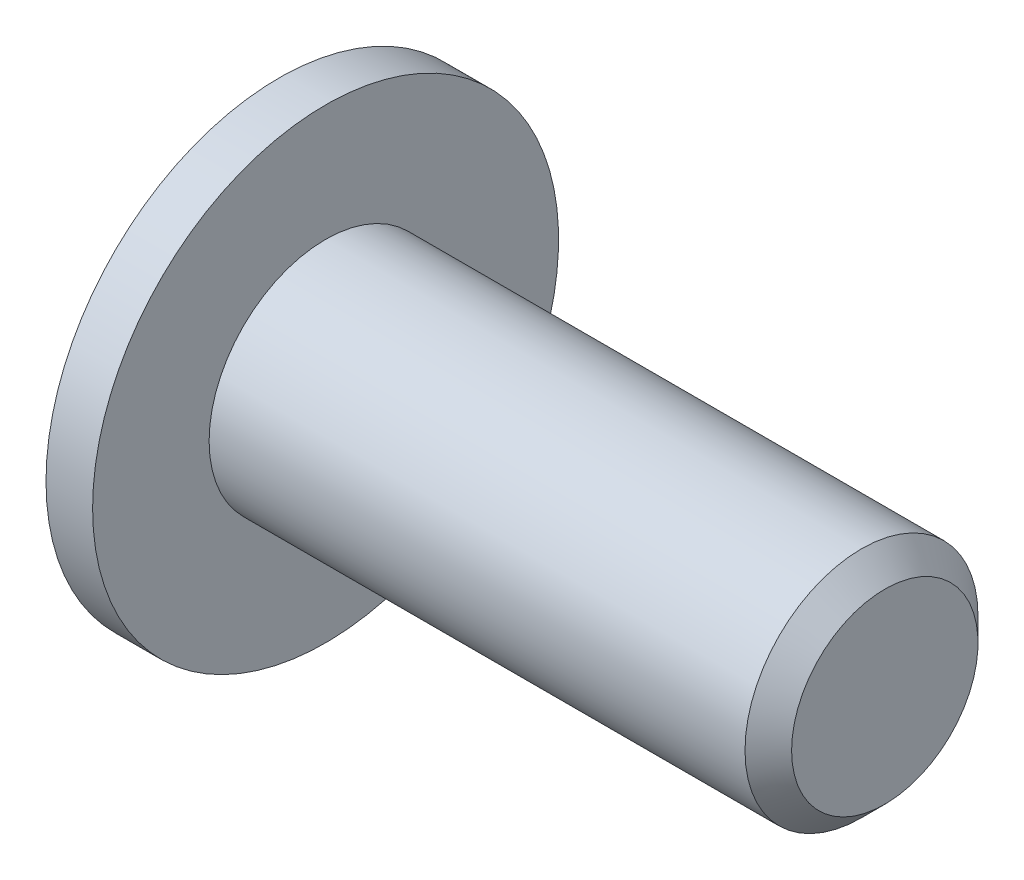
ISO-10303-21;
HEADER;
FILE_DESCRIPTION(('STEP AP214'),'2;1');
FILE_NAME('part.step','',(''),(''),'','','');
FILE_SCHEMA(('AUTOMOTIVE_DESIGN { 1 0 10303 214 1 1 1 1 }'));
ENDSEC;
DATA;
#1=APPLICATION_CONTEXT('core data for automotive mechanical design processes');
#2=APPLICATION_PROTOCOL_DEFINITION('international standard','automotive_design',2000,#1);
#3=PRODUCT_CONTEXT('',#1,'mechanical');
#4=PRODUCT('Part','Part','',(#3));
#5=PRODUCT_RELATED_PRODUCT_CATEGORY('part','',(#4));
#6=PRODUCT_DEFINITION_FORMATION('','',#4);
#7=PRODUCT_DEFINITION_CONTEXT('part definition',#1,'design');
#8=PRODUCT_DEFINITION('design','',#6,#7);
#9=PRODUCT_DEFINITION_SHAPE('','',#8);
#10=(LENGTH_UNIT() NAMED_UNIT(*) SI_UNIT(.MILLI.,.METRE.));
#11=(NAMED_UNIT(*) PLANE_ANGLE_UNIT() SI_UNIT($,.RADIAN.));
#12=(NAMED_UNIT(*) SI_UNIT($,.STERADIAN.) SOLID_ANGLE_UNIT());
#13=UNCERTAINTY_MEASURE_WITH_UNIT(LENGTH_MEASURE(1.E-05),#10,'distance_accuracy_value','');
#14=(GEOMETRIC_REPRESENTATION_CONTEXT(3) GLOBAL_UNCERTAINTY_ASSIGNED_CONTEXT((#13)) GLOBAL_UNIT_ASSIGNED_CONTEXT((#10,
#11,#12)) REPRESENTATION_CONTEXT('',''));
#15=CARTESIAN_POINT('',(0.,0.,0.));
#16=DIRECTION('',(0.,0.,1.));
#17=DIRECTION('',(1.,0.,0.));
#18=AXIS2_PLACEMENT_3D('',#15,#16,#17);
#19=CARTESIAN_POINT('',(12.,0.,0.));
#20=DIRECTION('',(-1.,0.,0.));
#21=DIRECTION('',(0.,0.,1.));
#22=AXIS2_PLACEMENT_3D('',#19,#20,#21);
#23=PLANE('',#22);
#24=CARTESIAN_POINT('',(12.,0.,0.));
#25=DIRECTION('',(-1.,0.,0.));
#26=DIRECTION('',(0.,0.,1.));
#27=AXIS2_PLACEMENT_3D('',#24,#25,#26);
#28=CIRCLE('',#27,2.);
#29=CARTESIAN_POINT('',(12.,0.,2.));
#30=VERTEX_POINT('',#29);
#31=EDGE_CURVE('E139',#30,#30,#28,.F.);
#32=ORIENTED_EDGE('',*,*,#31,.T.);
#33=EDGE_LOOP('',(#32));
#34=FACE_BOUND('',#33,.T.);
#35=ADVANCED_FACE('F35',(#34),#23,.F.);
#36=CARTESIAN_POINT('',(0.,0.,0.));
#37=DIRECTION('',(-1.,0.,0.));
#38=DIRECTION('',(0.,0.,1.));
#39=AXIS2_PLACEMENT_3D('',#36,#37,#38);
#40=CYLINDRICAL_SURFACE('',#39,2.5);
#41=CARTESIAN_POINT('',(11.5,0.,0.));
#42=DIRECTION('',(-1.,0.,0.));
#43=DIRECTION('',(0.,0.,1.));
#44=AXIS2_PLACEMENT_3D('',#41,#42,#43);
#45=CIRCLE('',#44,2.5);
#46=CARTESIAN_POINT('',(11.5,0.,2.5));
#47=VERTEX_POINT('',#46);
#48=EDGE_CURVE('E136',#47,#47,#45,.T.);
#49=ORIENTED_EDGE('',*,*,#48,.T.);
#50=EDGE_LOOP('',(#49));
#51=FACE_BOUND('',#50,.T.);
#52=CARTESIAN_POINT('',(0.,0.,0.));
#53=DIRECTION('',(-1.,0.,0.));
#54=DIRECTION('',(0.,0.,1.));
#55=AXIS2_PLACEMENT_3D('',#52,#53,#54);
#56=CIRCLE('',#55,2.5);
#57=CARTESIAN_POINT('',(0.,0.,2.5));
#58=VERTEX_POINT('',#57);
#59=EDGE_CURVE('E133',#58,#58,#56,.T.);
#60=ORIENTED_EDGE('',*,*,#59,.F.);
#61=EDGE_LOOP('',(#60));
#62=FACE_BOUND('',#61,.T.);
#63=ADVANCED_FACE('F176',(#51,#62),#40,.T.);
#64=CARTESIAN_POINT('',(0.,2.5,0.));
#65=DIRECTION('',(-1.,0.,0.));
#66=DIRECTION('',(0.,0.,1.));
#67=AXIS2_PLACEMENT_3D('',#64,#65,#66);
#68=PLANE('',#67);
#69=CARTESIAN_POINT('',(0.,0.,0.));
#70=DIRECTION('',(-1.,0.,0.));
#71=DIRECTION('',(0.,0.,1.));
#72=AXIS2_PLACEMENT_3D('',#69,#70,#71);
#73=CIRCLE('',#72,5.);
#74=CARTESIAN_POINT('',(0.,0.,5.));
#75=VERTEX_POINT('',#74);
#76=EDGE_CURVE('E130',#75,#75,#73,.T.);
#77=ORIENTED_EDGE('',*,*,#76,.F.);
#78=EDGE_LOOP('',(#77));
#79=FACE_BOUND('',#78,.T.);
#80=ORIENTED_EDGE('',*,*,#59,.T.);
#81=EDGE_LOOP('',(#80));
#82=FACE_BOUND('',#81,.T.);
#83=ADVANCED_FACE('F181',(#79,#82),#68,.F.);
#84=CARTESIAN_POINT('',(0.,0.,0.));
#85=DIRECTION('',(-1.,0.,0.));
#86=DIRECTION('',(0.,0.,1.));
#87=AXIS2_PLACEMENT_3D('',#84,#85,#86);
#88=CYLINDRICAL_SURFACE('',#87,5.);
#89=CARTESIAN_POINT('',(-1.,0.,0.));
#90=DIRECTION('',(-1.,0.,0.));
#91=DIRECTION('',(0.,0.,1.));
#92=AXIS2_PLACEMENT_3D('',#89,#90,#91);
#93=CIRCLE('',#92,5.);
#94=CARTESIAN_POINT('',(-1.,0.,5.));
#95=VERTEX_POINT('',#94);
#96=EDGE_CURVE('E127',#95,#95,#93,.T.);
#97=ORIENTED_EDGE('',*,*,#96,.F.);
#98=EDGE_LOOP('',(#97));
#99=FACE_BOUND('',#98,.T.);
#100=ORIENTED_EDGE('',*,*,#76,.T.);
#101=EDGE_LOOP('',(#100));
#102=FACE_BOUND('',#101,.T.);
#103=ADVANCED_FACE('F187',(#99,#102),#88,.T.);
#104=CARTESIAN_POINT('',(-1.,5.,0.));
#105=DIRECTION('',(1.,0.,0.));
#106=DIRECTION('',(0.,0.,-1.));
#107=AXIS2_PLACEMENT_3D('',#104,#105,#106);
#108=PLANE('',#107);
#109=CARTESIAN_POINT('',(-1.,0.,0.));
#110=DIRECTION('',(-1.,0.,0.));
#111=DIRECTION('',(0.,0.,1.));
#112=AXIS2_PLACEMENT_3D('',#109,#110,#111);
#113=CIRCLE('',#112,3.57071421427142);
#114=CARTESIAN_POINT('',(-1.,0.,3.57071421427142));
#115=VERTEX_POINT('',#114);
#116=EDGE_CURVE('E117',#115,#115,#113,.T.);
#117=ORIENTED_EDGE('',*,*,#116,.F.);
#118=EDGE_LOOP('',(#117));
#119=FACE_BOUND('',#118,.T.);
#120=ORIENTED_EDGE('',*,*,#96,.T.);
#121=EDGE_LOOP('',(#120));
#122=FACE_BOUND('',#121,.T.);
#123=ADVANCED_FACE('F191',(#119,#122),#108,.F.);
#124=CARTESIAN_POINT('',(2.5,0.,0.));
#125=DIRECTION('',(-1.,0.,0.));
#126=DIRECTION('',(0.,1.,0.));
#127=AXIS2_PLACEMENT_3D('',#124,#125,#126);
#128=SPHERICAL_SURFACE('',#127,5.);
#129=CARTESIAN_POINT('',(2.5,0.,-1.5));
#130=DIRECTION('',(0.,0.,-1.));
#131=DIRECTION('',(0.,1.,0.));
#132=AXIS2_PLACEMENT_3D('',#129,#130,#131);
#133=CIRCLE('',#132,4.76969600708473);
#134=CARTESIAN_POINT('',(-2.19041575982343,-0.866025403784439,-1.5));
#135=VERTEX_POINT('',#134);
#136=CARTESIAN_POINT('',(-2.19041575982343,0.866025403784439,-1.5));
#137=VERTEX_POINT('',#136);
#138=EDGE_CURVE('E43',#135,#137,#133,.T.);
#139=ORIENTED_EDGE('',*,*,#138,.T.);
#140=CARTESIAN_POINT('',(2.5,1.29903810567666,-0.75));
#141=DIRECTION('',(0.,0.866025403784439,-0.5));
#142=DIRECTION('',(0.,0.5,0.866025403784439));
#143=AXIS2_PLACEMENT_3D('',#140,#141,#142);
#144=CIRCLE('',#143,4.76969600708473);
#145=CARTESIAN_POINT('',(-2.19041575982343,1.73205080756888,0.));
#146=VERTEX_POINT('',#145);
#147=EDGE_CURVE('E11',#137,#146,#144,.T.);
#148=ORIENTED_EDGE('',*,*,#147,.T.);
#149=CARTESIAN_POINT('',(2.5,1.29903810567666,0.75));
#150=DIRECTION('',(0.,0.866025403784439,0.5));
#151=DIRECTION('',(0.,-0.5,0.866025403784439));
#152=AXIS2_PLACEMENT_3D('',#149,#150,#151);
#153=CIRCLE('',#152,4.76969600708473);
#154=CARTESIAN_POINT('',(-2.19041575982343,0.866025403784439,1.5));
#155=VERTEX_POINT('',#154);
#156=EDGE_CURVE('E89',#146,#155,#153,.T.);
#157=ORIENTED_EDGE('',*,*,#156,.T.);
#158=CARTESIAN_POINT('',(2.5,0.,1.5));
#159=DIRECTION('',(0.,0.,1.));
#160=DIRECTION('',(0.,-1.,0.));
#161=AXIS2_PLACEMENT_3D('',#158,#159,#160);
#162=CIRCLE('',#161,4.76969600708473);
#163=CARTESIAN_POINT('',(-2.19041575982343,-0.866025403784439,1.5));
#164=VERTEX_POINT('',#163);
#165=EDGE_CURVE('E143',#155,#164,#162,.T.);
#166=ORIENTED_EDGE('',*,*,#165,.T.);
#167=CARTESIAN_POINT('',(2.5,-1.29903810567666,0.749999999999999));
#168=DIRECTION('',(0.,-0.866025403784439,0.5));
#169=DIRECTION('',(0.,-0.5,-0.866025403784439));
#170=AXIS2_PLACEMENT_3D('',#167,#168,#169);
#171=CIRCLE('',#170,4.76969600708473);
#172=CARTESIAN_POINT('',(-2.19041575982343,-1.73205080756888,0.));
#173=VERTEX_POINT('',#172);
#174=EDGE_CURVE('E146',#164,#173,#171,.T.);
#175=ORIENTED_EDGE('',*,*,#174,.T.);
#176=CARTESIAN_POINT('',(2.5,-1.29903810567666,-0.75));
#177=DIRECTION('',(0.,-0.866025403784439,-0.5));
#178=DIRECTION('',(0.,0.5,-0.866025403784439));
#179=AXIS2_PLACEMENT_3D('',#176,#177,#178);
#180=CIRCLE('',#179,4.76969600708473);
#181=EDGE_CURVE('E149',#173,#135,#180,.T.);
#182=ORIENTED_EDGE('',*,*,#181,.T.);
#183=EDGE_LOOP('',(#139,#148,#157,#166,#175,#182));
#184=FACE_BOUND('',#183,.T.);
#185=ORIENTED_EDGE('',*,*,#116,.T.);
#186=EDGE_LOOP('',(#185));
#187=FACE_BOUND('',#186,.T.);
#188=ADVANCED_FACE('F153',(#184,#187),#128,.T.);
#189=CARTESIAN_POINT('',(11.5,0.,0.));
#190=DIRECTION('',(-1.,0.,0.));
#191=DIRECTION('',(0.,0.,1.));
#192=AXIS2_PLACEMENT_3D('',#189,#190,#191);
#193=CONICAL_SURFACE('',#192,2.5,0.785398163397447);
#194=ORIENTED_EDGE('',*,*,#31,.F.);
#195=EDGE_LOOP('',(#194));
#196=FACE_BOUND('',#195,.T.);
#197=ORIENTED_EDGE('',*,*,#48,.F.);
#198=EDGE_LOOP('',(#197));
#199=FACE_BOUND('',#198,.T.);
#200=ADVANCED_FACE('F37',(#196,#199),#193,.T.);
#201=CARTESIAN_POINT('',(-2.5,0.866025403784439,-1.5));
#202=DIRECTION('',(0.,0.866025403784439,-0.5));
#203=DIRECTION('',(0.,0.5,0.866025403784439));
#204=AXIS2_PLACEMENT_3D('',#201,#202,#203);
#205=PLANE('',#204);
#206=DIRECTION('',(1.,0.,0.));
#207=VECTOR('',#206,1.);
#208=CARTESIAN_POINT('',(-2.5,0.866025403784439,-1.5));
#209=LINE('',#208,#207);
#210=CARTESIAN_POINT('',(-1.,0.866025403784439,-1.5));
#211=VERTEX_POINT('',#210);
#212=EDGE_CURVE('E105',#137,#211,#209,.T.);
#213=ORIENTED_EDGE('',*,*,#212,.T.);
#214=DIRECTION('',(0.,0.5,0.866025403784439));
#215=VECTOR('',#214,1.);
#216=CARTESIAN_POINT('',(-1.,0.866025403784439,-1.5));
#217=LINE('',#216,#215);
#218=CARTESIAN_POINT('',(-1.,1.73205080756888,0.));
#219=VERTEX_POINT('',#218);
#220=EDGE_CURVE('E98',#211,#219,#217,.T.);
#221=ORIENTED_EDGE('',*,*,#220,.T.);
#222=DIRECTION('',(1.,0.,0.));
#223=VECTOR('',#222,1.);
#224=CARTESIAN_POINT('',(-2.5,1.73205080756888,0.));
#225=LINE('',#224,#223);
#226=EDGE_CURVE('E84',#146,#219,#225,.T.);
#227=ORIENTED_EDGE('',*,*,#226,.F.);
#228=ORIENTED_EDGE('',*,*,#147,.F.);
#229=EDGE_LOOP('',(#213,#221,#227,#228));
#230=FACE_BOUND('',#229,.T.);
#231=ADVANCED_FACE('F104',(#230),#205,.F.);
#232=CARTESIAN_POINT('',(-2.5,-0.866025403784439,-1.5));
#233=DIRECTION('',(0.,0.,-1.));
#234=DIRECTION('',(0.,1.,0.));
#235=AXIS2_PLACEMENT_3D('',#232,#233,#234);
#236=PLANE('',#235);
#237=DIRECTION('',(1.,0.,0.));
#238=VECTOR('',#237,1.);
#239=CARTESIAN_POINT('',(-2.5,-0.866025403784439,-1.5));
#240=LINE('',#239,#238);
#241=CARTESIAN_POINT('',(-1.,-0.866025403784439,-1.5));
#242=VERTEX_POINT('',#241);
#243=EDGE_CURVE('E118',#135,#242,#240,.T.);
#244=ORIENTED_EDGE('',*,*,#243,.T.);
#245=DIRECTION('',(0.,1.,0.));
#246=VECTOR('',#245,1.);
#247=CARTESIAN_POINT('',(-1.,-0.866025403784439,-1.5));
#248=LINE('',#247,#246);
#249=EDGE_CURVE('E91',#242,#211,#248,.T.);
#250=ORIENTED_EDGE('',*,*,#249,.T.);
#251=ORIENTED_EDGE('',*,*,#212,.F.);
#252=ORIENTED_EDGE('',*,*,#138,.F.);
#253=EDGE_LOOP('',(#244,#250,#251,#252));
#254=FACE_BOUND('',#253,.T.);
#255=ADVANCED_FACE('F157',(#254),#236,.F.);
#256=CARTESIAN_POINT('',(-2.5,-1.73205080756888,0.));
#257=DIRECTION('',(0.,-0.866025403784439,-0.5));
#258=DIRECTION('',(0.,0.5,-0.866025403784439));
#259=AXIS2_PLACEMENT_3D('',#256,#257,#258);
#260=PLANE('',#259);
#261=DIRECTION('',(1.,0.,0.));
#262=VECTOR('',#261,1.);
#263=CARTESIAN_POINT('',(-2.5,-1.73205080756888,0.));
#264=LINE('',#263,#262);
#265=CARTESIAN_POINT('',(-1.,-1.73205080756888,0.));
#266=VERTEX_POINT('',#265);
#267=EDGE_CURVE('E120',#173,#266,#264,.T.);
#268=ORIENTED_EDGE('',*,*,#267,.T.);
#269=DIRECTION('',(0.,0.5,-0.866025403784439));
#270=VECTOR('',#269,1.);
#271=CARTESIAN_POINT('',(-1.,-1.73205080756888,0.));
#272=LINE('',#271,#270);
#273=EDGE_CURVE('E112',#266,#242,#272,.T.);
#274=ORIENTED_EDGE('',*,*,#273,.T.);
#275=ORIENTED_EDGE('',*,*,#243,.F.);
#276=ORIENTED_EDGE('',*,*,#181,.F.);
#277=EDGE_LOOP('',(#268,#274,#275,#276));
#278=FACE_BOUND('',#277,.T.);
#279=ADVANCED_FACE('F159',(#278),#260,.F.);
#280=CARTESIAN_POINT('',(-2.5,-0.866025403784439,1.5));
#281=DIRECTION('',(0.,-0.866025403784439,0.5));
#282=DIRECTION('',(0.,-0.5,-0.866025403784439));
#283=AXIS2_PLACEMENT_3D('',#280,#281,#282);
#284=PLANE('',#283);
#285=DIRECTION('',(1.,0.,0.));
#286=VECTOR('',#285,1.);
#287=CARTESIAN_POINT('',(-2.5,-0.866025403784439,1.5));
#288=LINE('',#287,#286);
#289=CARTESIAN_POINT('',(-1.,-0.866025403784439,1.5));
#290=VERTEX_POINT('',#289);
#291=EDGE_CURVE('E122',#164,#290,#288,.T.);
#292=ORIENTED_EDGE('',*,*,#291,.T.);
#293=DIRECTION('',(0.,-0.5,-0.866025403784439));
#294=VECTOR('',#293,1.);
#295=CARTESIAN_POINT('',(-1.,-0.866025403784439,1.5));
#296=LINE('',#295,#294);
#297=EDGE_CURVE('E109',#290,#266,#296,.T.);
#298=ORIENTED_EDGE('',*,*,#297,.T.);
#299=ORIENTED_EDGE('',*,*,#267,.F.);
#300=ORIENTED_EDGE('',*,*,#174,.F.);
#301=EDGE_LOOP('',(#292,#298,#299,#300));
#302=FACE_BOUND('',#301,.T.);
#303=ADVANCED_FACE('F163',(#302),#284,.F.);
#304=CARTESIAN_POINT('',(-2.5,0.866025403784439,1.5));
#305=DIRECTION('',(0.,0.,1.));
#306=DIRECTION('',(0.,-1.,0.));
#307=AXIS2_PLACEMENT_3D('',#304,#305,#306);
#308=PLANE('',#307);
#309=DIRECTION('',(1.,0.,0.));
#310=VECTOR('',#309,1.);
#311=CARTESIAN_POINT('',(-2.5,0.866025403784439,1.5));
#312=LINE('',#311,#310);
#313=CARTESIAN_POINT('',(-1.,0.866025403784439,1.5));
#314=VERTEX_POINT('',#313);
#315=EDGE_CURVE('E50',#155,#314,#312,.T.);
#316=ORIENTED_EDGE('',*,*,#315,.T.);
#317=DIRECTION('',(0.,-1.,0.));
#318=VECTOR('',#317,1.);
#319=CARTESIAN_POINT('',(-1.,0.866025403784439,1.5));
#320=LINE('',#319,#318);
#321=EDGE_CURVE('E102',#314,#290,#320,.T.);
#322=ORIENTED_EDGE('',*,*,#321,.T.);
#323=ORIENTED_EDGE('',*,*,#291,.F.);
#324=ORIENTED_EDGE('',*,*,#165,.F.);
#325=EDGE_LOOP('',(#316,#322,#323,#324));
#326=FACE_BOUND('',#325,.T.);
#327=ADVANCED_FACE('F166',(#326),#308,.F.);
#328=CARTESIAN_POINT('',(-2.5,1.73205080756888,0.));
#329=DIRECTION('',(0.,0.866025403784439,0.5));
#330=DIRECTION('',(0.,-0.5,0.866025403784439));
#331=AXIS2_PLACEMENT_3D('',#328,#329,#330);
#332=PLANE('',#331);
#333=ORIENTED_EDGE('',*,*,#226,.T.);
#334=DIRECTION('',(0.,-0.5,0.866025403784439));
#335=VECTOR('',#334,1.);
#336=CARTESIAN_POINT('',(-1.,1.73205080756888,0.));
#337=LINE('',#336,#335);
#338=EDGE_CURVE('E87',#219,#314,#337,.T.);
#339=ORIENTED_EDGE('',*,*,#338,.T.);
#340=ORIENTED_EDGE('',*,*,#315,.F.);
#341=ORIENTED_EDGE('',*,*,#156,.F.);
#342=EDGE_LOOP('',(#333,#339,#340,#341));
#343=FACE_BOUND('',#342,.T.);
#344=ADVANCED_FACE('F86',(#343),#332,.F.);
#345=CARTESIAN_POINT('',(-1.,0.,0.));
#346=DIRECTION('',(1.,0.,0.));
#347=DIRECTION('',(0.,0.,-1.));
#348=AXIS2_PLACEMENT_3D('',#345,#346,#347);
#349=PLANE('',#348);
#350=ORIENTED_EDGE('',*,*,#220,.F.);
#351=ORIENTED_EDGE('',*,*,#249,.F.);
#352=ORIENTED_EDGE('',*,*,#273,.F.);
#353=ORIENTED_EDGE('',*,*,#297,.F.);
#354=ORIENTED_EDGE('',*,*,#321,.F.);
#355=ORIENTED_EDGE('',*,*,#338,.F.);
#356=EDGE_LOOP('',(#350,#351,#352,#353,#354,#355));
#357=FACE_BOUND('',#356,.T.);
#358=ADVANCED_FACE('F96',(#357),#349,.F.);
#359=CLOSED_SHELL('',(#35,#63,#83,#103,#123,#188,#200,#231,#255,#279,#303,#327,#344,#358));
#360=MANIFOLD_SOLID_BREP('B2',#359);
#361=ADVANCED_BREP_SHAPE_REPRESENTATION('',(#18,#360),#14);
#362=SHAPE_DEFINITION_REPRESENTATION(#9,#361);
ENDSEC;
END-ISO-10303-21;
